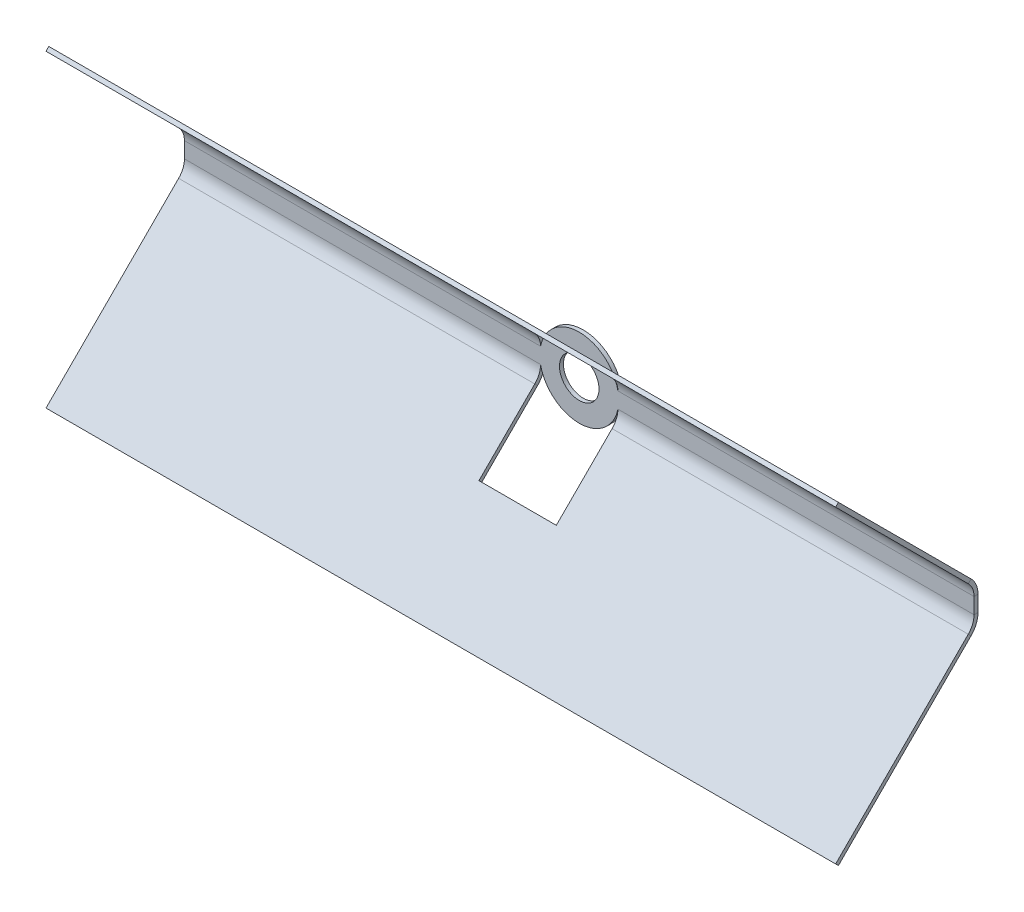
ISO-10303-21;
HEADER;
FILE_DESCRIPTION(('STEP AP214'),'2;1');
FILE_NAME('part.step','',(''),(''),'','','');
FILE_SCHEMA(('AUTOMOTIVE_DESIGN { 1 0 10303 214 1 1 1 1 }'));
ENDSEC;
DATA;
#1=APPLICATION_CONTEXT('core data for automotive mechanical design processes');
#2=APPLICATION_PROTOCOL_DEFINITION('international standard','automotive_design',2000,#1);
#3=PRODUCT_CONTEXT('',#1,'mechanical');
#4=PRODUCT('Part','Part','',(#3));
#5=PRODUCT_RELATED_PRODUCT_CATEGORY('part','',(#4));
#6=PRODUCT_DEFINITION_FORMATION('','',#4);
#7=PRODUCT_DEFINITION_CONTEXT('part definition',#1,'design');
#8=PRODUCT_DEFINITION('design','',#6,#7);
#9=PRODUCT_DEFINITION_SHAPE('','',#8);
#10=(LENGTH_UNIT() NAMED_UNIT(*) SI_UNIT(.MILLI.,.METRE.));
#11=(NAMED_UNIT(*) PLANE_ANGLE_UNIT() SI_UNIT($,.RADIAN.));
#12=(NAMED_UNIT(*) SI_UNIT($,.STERADIAN.) SOLID_ANGLE_UNIT());
#13=UNCERTAINTY_MEASURE_WITH_UNIT(LENGTH_MEASURE(1.E-05),#10,'distance_accuracy_value','');
#14=(GEOMETRIC_REPRESENTATION_CONTEXT(3) GLOBAL_UNCERTAINTY_ASSIGNED_CONTEXT((#13)) GLOBAL_UNIT_ASSIGNED_CONTEXT((#10,
#11,#12)) REPRESENTATION_CONTEXT('',''));
#15=CARTESIAN_POINT('',(0.,0.,0.));
#16=DIRECTION('',(0.,0.,1.));
#17=DIRECTION('',(1.,0.,0.));
#18=AXIS2_PLACEMENT_3D('',#15,#16,#17);
#19=CARTESIAN_POINT('',(-9.79795897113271,-39.8406204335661,34.3553390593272));
#20=DIRECTION('',(-1.,0.,0.));
#21=DIRECTION('',(0.,0.,1.));
#22=AXIS2_PLACEMENT_3D('',#19,#20,#21);
#23=PLANE('',#22);
#24=DIRECTION('',(0.,-0.707106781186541,-0.707106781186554));
#25=VECTOR('',#24,1.);
#26=CARTESIAN_POINT('',(-9.79795897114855,-20.3847763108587,14.8994949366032));
#27=LINE('',#26,#25);
#28=CARTESIAN_POINT('',(-9.79795897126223,-19.6776695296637,15.6066017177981));
#29=VERTEX_POINT('',#28);
#30=CARTESIAN_POINT('',(-9.79795897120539,-20.3847763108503,14.8994949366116));
#31=VERTEX_POINT('',#30);
#32=EDGE_CURVE('E277',#29,#31,#27,.T.);
#33=ORIENTED_EDGE('',*,*,#32,.T.);
#34=DIRECTION('',(0.,-0.707106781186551,0.707106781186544));
#35=VECTOR('',#34,1.);
#36=CARTESIAN_POINT('',(-9.79795897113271,-39.8406204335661,34.3553390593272));
#37=LINE('',#36,#35);
#38=CARTESIAN_POINT('',(-9.79795897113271,-6.24264068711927,0.75735931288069));
#39=VERTEX_POINT('',#38);
#40=EDGE_CURVE('E287',#39,#31,#37,.T.);
#41=ORIENTED_EDGE('',*,*,#40,.F.);
#42=DIRECTION('',(0.,0.707106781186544,0.707106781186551));
#43=VECTOR('',#42,1.);
#44=CARTESIAN_POINT('',(-9.79795897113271,-5.53553390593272,1.46446609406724));
#45=LINE('',#44,#43);
#46=CARTESIAN_POINT('',(-9.79795897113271,-5.53553390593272,1.46446609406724));
#47=VERTEX_POINT('',#46);
#48=EDGE_CURVE('E310',#47,#39,#45,.F.);
#49=ORIENTED_EDGE('',*,*,#48,.F.);
#50=DIRECTION('',(0.,0.707106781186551,-0.707106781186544));
#51=VECTOR('',#50,1.);
#52=CARTESIAN_POINT('',(-9.79795897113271,-39.1335136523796,35.0624458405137));
#53=LINE('',#52,#51);
#54=EDGE_CURVE('E289',#47,#29,#53,.F.);
#55=ORIENTED_EDGE('',*,*,#54,.T.);
#56=EDGE_LOOP('',(#33,#41,#49,#55));
#57=FACE_BOUND('',#56,.T.);
#58=ADVANCED_FACE('F113',(#57),#23,.F.);
#59=CARTESIAN_POINT('',(9.79795897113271,-4.77817459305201,-0.707106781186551));
#60=DIRECTION('',(1.,0.,0.));
#61=DIRECTION('',(0.,1.,0.));
#62=AXIS2_PLACEMENT_3D('',#59,#60,#61);
#63=PLANE('',#62);
#64=DIRECTION('',(0.,-0.70710678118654,-0.707106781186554));
#65=VECTOR('',#64,1.);
#66=CARTESIAN_POINT('',(9.79795897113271,-20.3847763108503,14.8994949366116));
#67=LINE('',#66,#65);
#68=CARTESIAN_POINT('',(9.79795897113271,-19.6776695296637,15.6066017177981));
#69=VERTEX_POINT('',#68);
#70=CARTESIAN_POINT('',(9.79795897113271,-20.3847763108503,14.8994949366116));
#71=VERTEX_POINT('',#70);
#72=EDGE_CURVE('E135',#69,#71,#67,.T.);
#73=ORIENTED_EDGE('',*,*,#72,.F.);
#74=DIRECTION('',(0.,-0.707106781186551,0.707106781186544));
#75=VECTOR('',#74,1.);
#76=CARTESIAN_POINT('',(9.79795897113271,-4.07106781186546,0.));
#77=LINE('',#76,#75);
#78=CARTESIAN_POINT('',(9.79795897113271,-5.53553390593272,1.46446609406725));
#79=VERTEX_POINT('',#78);
#80=EDGE_CURVE('E526',#69,#79,#77,.F.);
#81=ORIENTED_EDGE('',*,*,#80,.T.);
#82=DIRECTION('',(0.,0.707106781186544,0.707106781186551));
#83=VECTOR('',#82,1.);
#84=CARTESIAN_POINT('',(9.79795897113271,-6.24264068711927,0.757359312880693));
#85=LINE('',#84,#83);
#86=CARTESIAN_POINT('',(9.79795897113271,-6.24264068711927,0.757359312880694));
#87=VERTEX_POINT('',#86);
#88=EDGE_CURVE('E515',#79,#87,#85,.F.);
#89=ORIENTED_EDGE('',*,*,#88,.T.);
#90=DIRECTION('',(0.,0.707106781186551,-0.707106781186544));
#91=VECTOR('',#90,1.);
#92=CARTESIAN_POINT('',(9.79795897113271,-39.8406204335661,34.3553390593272));
#93=LINE('',#92,#91);
#94=EDGE_CURVE('E130',#71,#87,#93,.T.);
#95=ORIENTED_EDGE('',*,*,#94,.F.);
#96=EDGE_LOOP('',(#73,#81,#89,#95));
#97=FACE_BOUND('',#96,.T.);
#98=ADVANCED_FACE('F548',(#97),#63,.F.);
#99=CARTESIAN_POINT('',(-9.79795897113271,4.77817459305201,-0.707106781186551));
#100=DIRECTION('',(-1.,0.,0.));
#101=DIRECTION('',(0.,0.,1.));
#102=AXIS2_PLACEMENT_3D('',#99,#100,#101);
#103=PLANE('',#102);
#104=DIRECTION('',(0.,-0.70710678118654,0.707106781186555));
#105=VECTOR('',#104,1.);
#106=CARTESIAN_POINT('',(-9.79795897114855,17.8468127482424,12.3615313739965));
#107=LINE('',#106,#105);
#108=CARTESIAN_POINT('',(-9.79795897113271,17.8468127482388,12.3615313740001));
#109=VERTEX_POINT('',#108);
#110=CARTESIAN_POINT('',(-9.79795897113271,17.1397059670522,13.0686381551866));
#111=VERTEX_POINT('',#110);
#112=EDGE_CURVE('E518',#109,#111,#107,.T.);
#113=ORIENTED_EDGE('',*,*,#112,.T.);
#114=DIRECTION('',(0.,0.707106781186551,0.707106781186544));
#115=VECTOR('',#114,1.);
#116=CARTESIAN_POINT('',(-9.79795897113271,4.07106781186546,0.));
#117=LINE('',#116,#115);
#118=CARTESIAN_POINT('',(-9.79795897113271,5.53553390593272,1.46446609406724));
#119=VERTEX_POINT('',#118);
#120=EDGE_CURVE('E383',#111,#119,#117,.F.);
#121=ORIENTED_EDGE('',*,*,#120,.T.);
#122=DIRECTION('',(0.,-0.707106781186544,0.707106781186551));
#123=VECTOR('',#122,1.);
#124=CARTESIAN_POINT('',(-9.79795897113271,6.24264068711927,0.757359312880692));
#125=LINE('',#124,#123);
#126=CARTESIAN_POINT('',(-9.79795897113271,6.24264068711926,0.757359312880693));
#127=VERTEX_POINT('',#126);
#128=EDGE_CURVE('E360',#119,#127,#125,.F.);
#129=ORIENTED_EDGE('',*,*,#128,.T.);
#130=DIRECTION('',(0.,-0.707106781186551,-0.707106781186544));
#131=VECTOR('',#130,1.);
#132=CARTESIAN_POINT('',(-9.79795897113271,39.8406204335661,34.3553390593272));
#133=LINE('',#132,#131);
#134=EDGE_CURVE('E377',#109,#127,#133,.T.);
#135=ORIENTED_EDGE('',*,*,#134,.F.);
#136=EDGE_LOOP('',(#113,#121,#129,#135));
#137=FACE_BOUND('',#136,.T.);
#138=ADVANCED_FACE('F592',(#137),#103,.F.);
#139=CARTESIAN_POINT('',(9.79795897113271,39.8406204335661,34.3553390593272));
#140=DIRECTION('',(1.,0.,0.));
#141=DIRECTION('',(0.,0.,-1.));
#142=AXIS2_PLACEMENT_3D('',#139,#140,#141);
#143=PLANE('',#142);
#144=DIRECTION('',(0.,-0.70710678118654,0.707106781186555));
#145=VECTOR('',#144,1.);
#146=CARTESIAN_POINT('',(9.79795897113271,17.8468127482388,12.3615313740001));
#147=LINE('',#146,#145);
#148=CARTESIAN_POINT('',(9.79795897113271,17.8468127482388,12.3615313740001));
#149=VERTEX_POINT('',#148);
#150=CARTESIAN_POINT('',(9.79795897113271,17.1397059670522,13.0686381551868));
#151=VERTEX_POINT('',#150);
#152=EDGE_CURVE('E539',#149,#151,#147,.T.);
#153=ORIENTED_EDGE('',*,*,#152,.F.);
#154=DIRECTION('',(0.,0.707106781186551,0.707106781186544));
#155=VECTOR('',#154,1.);
#156=CARTESIAN_POINT('',(9.79795897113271,39.8406204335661,34.3553390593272));
#157=LINE('',#156,#155);
#158=CARTESIAN_POINT('',(9.79795897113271,6.24264068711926,0.757359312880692));
#159=VERTEX_POINT('',#158);
#160=EDGE_CURVE('E336',#159,#149,#157,.T.);
#161=ORIENTED_EDGE('',*,*,#160,.F.);
#162=DIRECTION('',(0.,-0.707106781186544,0.707106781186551));
#163=VECTOR('',#162,1.);
#164=CARTESIAN_POINT('',(9.79795897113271,5.53553390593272,1.46446609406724));
#165=LINE('',#164,#163);
#166=CARTESIAN_POINT('',(9.79795897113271,5.53553390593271,1.46446609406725));
#167=VERTEX_POINT('',#166);
#168=EDGE_CURVE('E350',#167,#159,#165,.F.);
#169=ORIENTED_EDGE('',*,*,#168,.F.);
#170=DIRECTION('',(0.,-0.707106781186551,-0.707106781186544));
#171=VECTOR('',#170,1.);
#172=CARTESIAN_POINT('',(9.79795897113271,39.1335136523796,35.0624458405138));
#173=LINE('',#172,#171);
#174=EDGE_CURVE('E342',#167,#151,#173,.F.);
#175=ORIENTED_EDGE('',*,*,#174,.T.);
#176=EDGE_LOOP('',(#153,#161,#169,#175));
#177=FACE_BOUND('',#176,.T.);
#178=ADVANCED_FACE('F955',(#177),#143,.F.);
#179=CARTESIAN_POINT('',(-100.,2.,-1.));
#180=DIRECTION('',(-1.,0.,0.));
#181=DIRECTION('',(0.,0.,1.));
#182=AXIS2_PLACEMENT_3D('',#179,#180,#181);
#183=PLANE('',#182);
#184=DIRECTION('',(0.,-1.,0.));
#185=VECTOR('',#184,1.);
#186=CARTESIAN_POINT('',(-100.,2.,0.));
#187=LINE('',#186,#185);
#188=CARTESIAN_POINT('',(-100.,2.,0.));
#189=VERTEX_POINT('',#188);
#190=CARTESIAN_POINT('',(-100.,-2.,0.));
#191=VERTEX_POINT('',#190);
#192=EDGE_CURVE('E410',#189,#191,#187,.T.);
#193=ORIENTED_EDGE('',*,*,#192,.F.);
#194=DIRECTION('',(0.,0.,1.));
#195=VECTOR('',#194,1.);
#196=CARTESIAN_POINT('',(-100.,2.,-1.));
#197=LINE('',#196,#195);
#198=CARTESIAN_POINT('',(-100.,2.,-0.999999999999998));
#199=VERTEX_POINT('',#198);
#200=EDGE_CURVE('E13',#199,#189,#197,.T.);
#201=ORIENTED_EDGE('',*,*,#200,.F.);
#202=DIRECTION('',(0.,-1.,0.));
#203=VECTOR('',#202,1.);
#204=CARTESIAN_POINT('',(-100.,2.,-1.));
#205=LINE('',#204,#203);
#206=CARTESIAN_POINT('',(-100.,-2.,-1.));
#207=VERTEX_POINT('',#206);
#208=EDGE_CURVE('E413',#199,#207,#205,.T.);
#209=ORIENTED_EDGE('',*,*,#208,.T.);
#210=DIRECTION('',(0.,0.,1.));
#211=VECTOR('',#210,1.);
#212=CARTESIAN_POINT('',(-100.,-2.,-1.));
#213=LINE('',#212,#211);
#214=EDGE_CURVE('E117',#207,#191,#213,.T.);
#215=ORIENTED_EDGE('',*,*,#214,.T.);
#216=EDGE_LOOP('',(#193,#201,#209,#215));
#217=FACE_BOUND('',#216,.T.);
#218=ADVANCED_FACE('F115',(#217),#183,.T.);
#219=CARTESIAN_POINT('',(0.,0.,-1.));
#220=DIRECTION('',(0.,0.,1.));
#221=DIRECTION('',(1.,0.,0.));
#222=AXIS2_PLACEMENT_3D('',#219,#220,#221);
#223=CYLINDRICAL_SURFACE('',#222,10.);
#224=CARTESIAN_POINT('',(0.,0.,0.));
#225=DIRECTION('',(0.,0.,1.));
#226=DIRECTION('',(1.,0.,0.));
#227=AXIS2_PLACEMENT_3D('',#224,#225,#226);
#228=CIRCLE('',#227,10.);
#229=CARTESIAN_POINT('',(9.79795897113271,2.,0.));
#230=VERTEX_POINT('',#229);
#231=CARTESIAN_POINT('',(-9.79795897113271,2.,0.));
#232=VERTEX_POINT('',#231);
#233=EDGE_CURVE('E454',#230,#232,#228,.T.);
#234=ORIENTED_EDGE('',*,*,#233,.F.);
#235=DIRECTION('',(0.,0.,1.));
#236=VECTOR('',#235,1.);
#237=CARTESIAN_POINT('',(9.79795897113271,2.,-1.));
#238=LINE('',#237,#236);
#239=CARTESIAN_POINT('',(9.79795897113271,2.,-0.999999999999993));
#240=VERTEX_POINT('',#239);
#241=EDGE_CURVE('E460',#240,#230,#238,.T.);
#242=ORIENTED_EDGE('',*,*,#241,.F.);
#243=CARTESIAN_POINT('',(0.,0.,-1.));
#244=DIRECTION('',(0.,0.,1.));
#245=DIRECTION('',(1.,0.,0.));
#246=AXIS2_PLACEMENT_3D('',#243,#244,#245);
#247=CIRCLE('',#246,10.);
#248=CARTESIAN_POINT('',(-9.79795897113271,2.,-1.));
#249=VERTEX_POINT('',#248);
#250=EDGE_CURVE('E432',#240,#249,#247,.T.);
#251=ORIENTED_EDGE('',*,*,#250,.T.);
#252=DIRECTION('',(0.,0.,1.));
#253=VECTOR('',#252,1.);
#254=CARTESIAN_POINT('',(-9.79795897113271,2.,-1.));
#255=LINE('',#254,#253);
#256=EDGE_CURVE('E122',#249,#232,#255,.T.);
#257=ORIENTED_EDGE('',*,*,#256,.T.);
#258=EDGE_LOOP('',(#234,#242,#251,#257));
#259=FACE_BOUND('',#258,.T.);
#260=ADVANCED_FACE('F937',(#259),#223,.T.);
#261=CARTESIAN_POINT('',(100.,2.,-1.));
#262=DIRECTION('',(1.,0.,0.));
#263=DIRECTION('',(0.,0.,-1.));
#264=AXIS2_PLACEMENT_3D('',#261,#262,#263);
#265=PLANE('',#264);
#266=DIRECTION('',(0.,1.,0.));
#267=VECTOR('',#266,1.);
#268=CARTESIAN_POINT('',(100.,2.,0.));
#269=LINE('',#268,#267);
#270=CARTESIAN_POINT('',(100.,-2.,0.));
#271=VERTEX_POINT('',#270);
#272=CARTESIAN_POINT('',(100.,2.,0.));
#273=VERTEX_POINT('',#272);
#274=EDGE_CURVE('E448',#271,#273,#269,.T.);
#275=ORIENTED_EDGE('',*,*,#274,.F.);
#276=DIRECTION('',(0.,0.,1.));
#277=VECTOR('',#276,1.);
#278=CARTESIAN_POINT('',(100.,-2.,-1.));
#279=LINE('',#278,#277);
#280=CARTESIAN_POINT('',(100.,-2.,-1.00000000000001));
#281=VERTEX_POINT('',#280);
#282=EDGE_CURVE('E465',#281,#271,#279,.T.);
#283=ORIENTED_EDGE('',*,*,#282,.F.);
#284=DIRECTION('',(0.,1.,0.));
#285=VECTOR('',#284,1.);
#286=CARTESIAN_POINT('',(100.,2.,-1.));
#287=LINE('',#286,#285);
#288=CARTESIAN_POINT('',(100.,2.,-1.));
#289=VERTEX_POINT('',#288);
#290=EDGE_CURVE('E426',#281,#289,#287,.T.);
#291=ORIENTED_EDGE('',*,*,#290,.T.);
#292=DIRECTION('',(0.,0.,1.));
#293=VECTOR('',#292,1.);
#294=CARTESIAN_POINT('',(100.,2.,-1.));
#295=LINE('',#294,#293);
#296=EDGE_CURVE('E463',#289,#273,#295,.T.);
#297=ORIENTED_EDGE('',*,*,#296,.T.);
#298=EDGE_LOOP('',(#275,#283,#291,#297));
#299=FACE_BOUND('',#298,.T.);
#300=ADVANCED_FACE('F564',(#299),#265,.T.);
#301=CARTESIAN_POINT('',(0.,0.,-1.));
#302=DIRECTION('',(0.,0.,1.));
#303=DIRECTION('',(1.,0.,0.));
#304=AXIS2_PLACEMENT_3D('',#301,#302,#303);
#305=CYLINDRICAL_SURFACE('',#304,10.);
#306=CARTESIAN_POINT('',(0.,0.,0.));
#307=DIRECTION('',(0.,0.,1.));
#308=DIRECTION('',(1.,0.,0.));
#309=AXIS2_PLACEMENT_3D('',#306,#307,#308);
#310=CIRCLE('',#309,10.);
#311=CARTESIAN_POINT('',(-9.79795897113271,-2.,0.));
#312=VERTEX_POINT('',#311);
#313=CARTESIAN_POINT('',(9.79795897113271,-2.,0.));
#314=VERTEX_POINT('',#313);
#315=EDGE_CURVE('E442',#312,#314,#310,.T.);
#316=ORIENTED_EDGE('',*,*,#315,.F.);
#317=DIRECTION('',(0.,0.,1.));
#318=VECTOR('',#317,1.);
#319=CARTESIAN_POINT('',(-9.79795897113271,-2.,-1.));
#320=LINE('',#319,#318);
#321=CARTESIAN_POINT('',(-9.79795897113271,-2.,-0.999999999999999));
#322=VERTEX_POINT('',#321);
#323=EDGE_CURVE('E469',#322,#312,#320,.T.);
#324=ORIENTED_EDGE('',*,*,#323,.F.);
#325=CARTESIAN_POINT('',(0.,0.,-1.));
#326=DIRECTION('',(0.,0.,1.));
#327=DIRECTION('',(1.,0.,0.));
#328=AXIS2_PLACEMENT_3D('',#325,#326,#327);
#329=CIRCLE('',#328,10.);
#330=CARTESIAN_POINT('',(9.79795897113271,-2.,-1.));
#331=VERTEX_POINT('',#330);
#332=EDGE_CURVE('E420',#322,#331,#329,.T.);
#333=ORIENTED_EDGE('',*,*,#332,.T.);
#334=DIRECTION('',(0.,0.,1.));
#335=VECTOR('',#334,1.);
#336=CARTESIAN_POINT('',(9.79795897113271,-2.,-1.));
#337=LINE('',#336,#335);
#338=EDGE_CURVE('E468',#331,#314,#337,.T.);
#339=ORIENTED_EDGE('',*,*,#338,.T.);
#340=EDGE_LOOP('',(#316,#324,#333,#339));
#341=FACE_BOUND('',#340,.T.);
#342=ADVANCED_FACE('F571',(#341),#305,.T.);
#343=CARTESIAN_POINT('',(0.,0.,-1.));
#344=DIRECTION('',(0.,0.,1.));
#345=DIRECTION('',(1.,0.,0.));
#346=AXIS2_PLACEMENT_3D('',#343,#344,#345);
#347=PLANE('',#346);
#348=CARTESIAN_POINT('',(0.,0.,-1.));
#349=DIRECTION('',(0.,0.,1.));
#350=DIRECTION('',(1.,0.,0.));
#351=AXIS2_PLACEMENT_3D('',#348,#349,#350);
#352=CIRCLE('',#351,5.);
#353=CARTESIAN_POINT('',(5.,0.,-1.));
#354=VERTEX_POINT('',#353);
#355=EDGE_CURVE('E407',#354,#354,#352,.T.);
#356=ORIENTED_EDGE('',*,*,#355,.T.);
#357=EDGE_LOOP('',(#356));
#358=FACE_BOUND('',#357,.T.);
#359=ORIENTED_EDGE('',*,*,#208,.F.);
#360=DIRECTION('',(-1.,0.,0.));
#361=VECTOR('',#360,1.);
#362=CARTESIAN_POINT('',(-100.,2.,-1.));
#363=LINE('',#362,#361);
#364=EDGE_CURVE('E434',#249,#199,#363,.T.);
#365=ORIENTED_EDGE('',*,*,#364,.F.);
#366=ORIENTED_EDGE('',*,*,#250,.F.);
#367=DIRECTION('',(-1.,0.,0.));
#368=VECTOR('',#367,1.);
#369=CARTESIAN_POINT('',(9.79795897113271,2.,-1.));
#370=LINE('',#369,#368);
#371=EDGE_CURVE('E429',#289,#240,#370,.T.);
#372=ORIENTED_EDGE('',*,*,#371,.F.);
#373=ORIENTED_EDGE('',*,*,#290,.F.);
#374=DIRECTION('',(1.,0.,0.));
#375=VECTOR('',#374,1.);
#376=CARTESIAN_POINT('',(9.79795897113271,-2.,-1.));
#377=LINE('',#376,#375);
#378=EDGE_CURVE('E423',#331,#281,#377,.T.);
#379=ORIENTED_EDGE('',*,*,#378,.F.);
#380=ORIENTED_EDGE('',*,*,#332,.F.);
#381=DIRECTION('',(1.,0.,0.));
#382=VECTOR('',#381,1.);
#383=CARTESIAN_POINT('',(-100.,-2.,-1.));
#384=LINE('',#383,#382);
#385=EDGE_CURVE('E416',#207,#322,#384,.T.);
#386=ORIENTED_EDGE('',*,*,#385,.F.);
#387=EDGE_LOOP('',(#359,#365,#366,#372,#373,#379,#380,#386));
#388=FACE_BOUND('',#387,.T.);
#389=ADVANCED_FACE('F569',(#358,#388),#347,.F.);
#390=CARTESIAN_POINT('',(0.,0.,0.));
#391=DIRECTION('',(0.,0.,1.));
#392=DIRECTION('',(1.,0.,0.));
#393=AXIS2_PLACEMENT_3D('',#390,#391,#392);
#394=PLANE('',#393);
#395=CARTESIAN_POINT('',(0.,0.,0.));
#396=DIRECTION('',(0.,0.,1.));
#397=DIRECTION('',(1.,0.,0.));
#398=AXIS2_PLACEMENT_3D('',#395,#396,#397);
#399=CIRCLE('',#398,5.);
#400=CARTESIAN_POINT('',(5.,0.,0.));
#401=VERTEX_POINT('',#400);
#402=EDGE_CURVE('E398',#401,#401,#399,.T.);
#403=ORIENTED_EDGE('',*,*,#402,.F.);
#404=EDGE_LOOP('',(#403));
#405=FACE_BOUND('',#404,.T.);
#406=ORIENTED_EDGE('',*,*,#192,.T.);
#407=DIRECTION('',(1.,0.,0.));
#408=VECTOR('',#407,1.);
#409=CARTESIAN_POINT('',(-100.,-2.,0.));
#410=LINE('',#409,#408);
#411=EDGE_CURVE('E439',#191,#312,#410,.T.);
#412=ORIENTED_EDGE('',*,*,#411,.T.);
#413=ORIENTED_EDGE('',*,*,#315,.T.);
#414=DIRECTION('',(1.,0.,0.));
#415=VECTOR('',#414,1.);
#416=CARTESIAN_POINT('',(9.79795897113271,-2.,0.));
#417=LINE('',#416,#415);
#418=EDGE_CURVE('E445',#314,#271,#417,.T.);
#419=ORIENTED_EDGE('',*,*,#418,.T.);
#420=ORIENTED_EDGE('',*,*,#274,.T.);
#421=DIRECTION('',(-1.,0.,0.));
#422=VECTOR('',#421,1.);
#423=CARTESIAN_POINT('',(9.79795897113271,2.,0.));
#424=LINE('',#423,#422);
#425=EDGE_CURVE('E451',#273,#230,#424,.T.);
#426=ORIENTED_EDGE('',*,*,#425,.T.);
#427=ORIENTED_EDGE('',*,*,#233,.T.);
#428=DIRECTION('',(-1.,0.,0.));
#429=VECTOR('',#428,1.);
#430=CARTESIAN_POINT('',(-100.,2.,0.));
#431=LINE('',#430,#429);
#432=EDGE_CURVE('E417',#232,#189,#431,.T.);
#433=ORIENTED_EDGE('',*,*,#432,.T.);
#434=EDGE_LOOP('',(#406,#412,#413,#419,#420,#426,#427,#433));
#435=FACE_BOUND('',#434,.T.);
#436=ADVANCED_FACE('F482',(#405,#435),#394,.T.);
#437=CARTESIAN_POINT('',(0.,0.,-1.));
#438=DIRECTION('',(0.,0.,1.));
#439=DIRECTION('',(1.,0.,0.));
#440=AXIS2_PLACEMENT_3D('',#437,#438,#439);
#441=CYLINDRICAL_SURFACE('',#440,5.);
#442=ORIENTED_EDGE('',*,*,#355,.F.);
#443=EDGE_LOOP('',(#442));
#444=FACE_BOUND('',#443,.T.);
#445=ORIENTED_EDGE('',*,*,#402,.T.);
#446=EDGE_LOOP('',(#445));
#447=FACE_BOUND('',#446,.T.);
#448=ADVANCED_FACE('F887',(#444,#447),#441,.F.);
#449=CARTESIAN_POINT('',(-9.79795897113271,2.,5.));
#450=DIRECTION('',(1.,0.,0.));
#451=DIRECTION('',(0.,1.,0.));
#452=AXIS2_PLACEMENT_3D('',#449,#450,#451);
#453=PLANE('',#452);
#454=ORIENTED_EDGE('',*,*,#128,.F.);
#455=CARTESIAN_POINT('',(-9.79795897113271,2.,5.));
#456=DIRECTION('',(-1.,0.,0.));
#457=DIRECTION('',(0.,-1.,0.));
#458=AXIS2_PLACEMENT_3D('',#455,#456,#457);
#459=CIRCLE('',#458,5.);
#460=EDGE_CURVE('E402',#232,#119,#459,.F.);
#461=ORIENTED_EDGE('',*,*,#460,.F.);
#462=ORIENTED_EDGE('',*,*,#256,.F.);
#463=CARTESIAN_POINT('',(-9.79795897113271,2.,5.));
#464=DIRECTION('',(-1.,0.,0.));
#465=DIRECTION('',(0.,-1.,0.));
#466=AXIS2_PLACEMENT_3D('',#463,#464,#465);
#467=CIRCLE('',#466,6.);
#468=EDGE_CURVE('E395',#249,#127,#467,.F.);
#469=ORIENTED_EDGE('',*,*,#468,.T.);
#470=EDGE_LOOP('',(#454,#461,#462,#469));
#471=FACE_BOUND('',#470,.T.);
#472=ADVANCED_FACE('F868',(#471),#453,.T.);
#473=CARTESIAN_POINT('',(-100.,2.,5.));
#474=DIRECTION('',(1.,0.,0.));
#475=DIRECTION('',(0.,1.,0.));
#476=AXIS2_PLACEMENT_3D('',#473,#474,#475);
#477=PLANE('',#476);
#478=CARTESIAN_POINT('',(-100.,2.,5.));
#479=DIRECTION('',(-1.,0.,0.));
#480=DIRECTION('',(0.,-1.,0.));
#481=AXIS2_PLACEMENT_3D('',#478,#479,#480);
#482=CIRCLE('',#481,5.);
#483=CARTESIAN_POINT('',(-100.,5.53553390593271,1.46446609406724));
#484=VERTEX_POINT('',#483);
#485=EDGE_CURVE('E372',#484,#189,#482,.T.);
#486=ORIENTED_EDGE('',*,*,#485,.F.);
#487=DIRECTION('',(0.,-0.707106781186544,0.707106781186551));
#488=VECTOR('',#487,1.);
#489=CARTESIAN_POINT('',(-100.,5.53553390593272,1.46446609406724));
#490=LINE('',#489,#488);
#491=CARTESIAN_POINT('',(-100.,6.24264068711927,0.757359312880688));
#492=VERTEX_POINT('',#491);
#493=EDGE_CURVE('E388',#484,#492,#490,.F.);
#494=ORIENTED_EDGE('',*,*,#493,.T.);
#495=CARTESIAN_POINT('',(-100.,2.,5.));
#496=DIRECTION('',(-1.,0.,0.));
#497=DIRECTION('',(0.,-1.,0.));
#498=AXIS2_PLACEMENT_3D('',#495,#496,#497);
#499=CIRCLE('',#498,6.);
#500=EDGE_CURVE('E399',#492,#199,#499,.T.);
#501=ORIENTED_EDGE('',*,*,#500,.T.);
#502=ORIENTED_EDGE('',*,*,#200,.T.);
#503=EDGE_LOOP('',(#486,#494,#501,#502));
#504=FACE_BOUND('',#503,.T.);
#505=ADVANCED_FACE('F857',(#504),#477,.F.);
#506=CARTESIAN_POINT('',(-100.,2.,5.));
#507=DIRECTION('',(-1.,0.,0.));
#508=DIRECTION('',(0.,0.707106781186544,-0.707106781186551));
#509=AXIS2_PLACEMENT_3D('',#506,#507,#508);
#510=CYLINDRICAL_SURFACE('',#509,6.);
#511=ORIENTED_EDGE('',*,*,#364,.T.);
#512=ORIENTED_EDGE('',*,*,#500,.F.);
#513=DIRECTION('',(-1.,0.,0.));
#514=VECTOR('',#513,1.);
#515=CARTESIAN_POINT('',(-9.79795897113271,6.24264068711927,0.757359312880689));
#516=LINE('',#515,#514);
#517=EDGE_CURVE('E385',#492,#127,#516,.F.);
#518=ORIENTED_EDGE('',*,*,#517,.T.);
#519=ORIENTED_EDGE('',*,*,#468,.F.);
#520=EDGE_LOOP('',(#511,#512,#518,#519));
#521=FACE_BOUND('',#520,.T.);
#522=ADVANCED_FACE('F854',(#521),#510,.T.);
#523=CARTESIAN_POINT('',(-100.,2.,5.));
#524=DIRECTION('',(-1.,0.,0.));
#525=DIRECTION('',(0.,0.707106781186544,-0.707106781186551));
#526=AXIS2_PLACEMENT_3D('',#523,#524,#525);
#527=CYLINDRICAL_SURFACE('',#526,5.);
#528=ORIENTED_EDGE('',*,*,#432,.F.);
#529=ORIENTED_EDGE('',*,*,#460,.T.);
#530=DIRECTION('',(-1.,0.,0.));
#531=VECTOR('',#530,1.);
#532=CARTESIAN_POINT('',(-9.79795897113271,5.53553390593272,1.46446609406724));
#533=LINE('',#532,#531);
#534=EDGE_CURVE('E391',#119,#484,#533,.T.);
#535=ORIENTED_EDGE('',*,*,#534,.T.);
#536=ORIENTED_EDGE('',*,*,#485,.T.);
#537=EDGE_LOOP('',(#528,#529,#535,#536));
#538=FACE_BOUND('',#537,.T.);
#539=ADVANCED_FACE('F843',(#538),#527,.F.);
#540=CARTESIAN_POINT('',(-100.,39.8406204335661,34.3553390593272));
#541=DIRECTION('',(1.,0.,0.));
#542=DIRECTION('',(0.,0.,-1.));
#543=AXIS2_PLACEMENT_3D('',#540,#541,#542);
#544=PLANE('',#543);
#545=ORIENTED_EDGE('',*,*,#493,.F.);
#546=DIRECTION('',(0.,-0.707106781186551,-0.707106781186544));
#547=VECTOR('',#546,1.);
#548=CARTESIAN_POINT('',(-100.,39.1335136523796,35.0624458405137));
#549=LINE('',#548,#547);
#550=CARTESIAN_POINT('',(-100.,39.1335136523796,35.0624458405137));
#551=VERTEX_POINT('',#550);
#552=EDGE_CURVE('E381',#484,#551,#549,.F.);
#553=ORIENTED_EDGE('',*,*,#552,.T.);
#554=DIRECTION('',(0.,-0.707106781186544,0.707106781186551));
#555=VECTOR('',#554,1.);
#556=CARTESIAN_POINT('',(-100.,39.8406204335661,34.3553390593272));
#557=LINE('',#556,#555);
#558=CARTESIAN_POINT('',(-100.,39.8406204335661,34.3553390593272));
#559=VERTEX_POINT('',#558);
#560=EDGE_CURVE('E369',#559,#551,#557,.T.);
#561=ORIENTED_EDGE('',*,*,#560,.F.);
#562=DIRECTION('',(0.,0.707106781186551,0.707106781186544));
#563=VECTOR('',#562,1.);
#564=CARTESIAN_POINT('',(-100.,39.8406204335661,34.3553390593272));
#565=LINE('',#564,#563);
#566=EDGE_CURVE('E375',#492,#559,#565,.T.);
#567=ORIENTED_EDGE('',*,*,#566,.F.);
#568=EDGE_LOOP('',(#545,#553,#561,#567));
#569=FACE_BOUND('',#568,.T.);
#570=ADVANCED_FACE('F831',(#569),#544,.F.);
#571=CARTESIAN_POINT('',(-9.79795897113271,39.8406204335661,34.3553390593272));
#572=DIRECTION('',(0.,-0.707106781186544,0.707106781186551));
#573=DIRECTION('',(0.,-0.707106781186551,-0.707106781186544));
#574=AXIS2_PLACEMENT_3D('',#571,#572,#573);
#575=PLANE('',#574);
#576=ORIENTED_EDGE('',*,*,#517,.F.);
#577=ORIENTED_EDGE('',*,*,#566,.T.);
#578=DIRECTION('',(1.,0.,0.));
#579=VECTOR('',#578,1.);
#580=CARTESIAN_POINT('',(-9.79795897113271,39.8406204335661,34.3553390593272));
#581=LINE('',#580,#579);
#582=CARTESIAN_POINT('',(100.,39.8406204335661,34.3553390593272));
#583=VERTEX_POINT('',#582);
#584=EDGE_CURVE('E373',#559,#583,#581,.T.);
#585=ORIENTED_EDGE('',*,*,#584,.T.);
#586=DIRECTION('',(0.,-0.707106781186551,-0.707106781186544));
#587=VECTOR('',#586,1.);
#588=CARTESIAN_POINT('',(100.,39.8406204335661,34.3553390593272));
#589=LINE('',#588,#587);
#590=CARTESIAN_POINT('',(100.,6.24264068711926,0.75735931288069));
#591=VERTEX_POINT('',#590);
#592=EDGE_CURVE('E339',#583,#591,#589,.T.);
#593=ORIENTED_EDGE('',*,*,#592,.T.);
#594=DIRECTION('',(-1.,0.,0.));
#595=VECTOR('',#594,1.);
#596=CARTESIAN_POINT('',(100.,6.24264068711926,0.757359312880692));
#597=LINE('',#596,#595);
#598=EDGE_CURVE('E348',#159,#591,#597,.F.);
#599=ORIENTED_EDGE('',*,*,#598,.F.);
#600=ORIENTED_EDGE('',*,*,#160,.T.);
#601=DIRECTION('',(1.,0.,0.));
#602=VECTOR('',#601,1.);
#603=CARTESIAN_POINT('',(-500000.,17.8468127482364,12.3615313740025));
#604=LINE('',#603,#602);
#605=EDGE_CURVE('E535',#109,#149,#604,.T.);
#606=ORIENTED_EDGE('',*,*,#605,.F.);
#607=ORIENTED_EDGE('',*,*,#134,.T.);
#608=EDGE_LOOP('',(#576,#577,#585,#593,#599,#600,#606,#607));
#609=FACE_BOUND('',#608,.T.);
#610=ADVANCED_FACE('F818',(#609),#575,.F.);
#611=CARTESIAN_POINT('',(-9.79795897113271,39.1335136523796,35.0624458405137));
#612=DIRECTION('',(0.,-0.707106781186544,0.707106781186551));
#613=DIRECTION('',(0.,-0.707106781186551,-0.707106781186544));
#614=AXIS2_PLACEMENT_3D('',#611,#612,#613);
#615=PLANE('',#614);
#616=ORIENTED_EDGE('',*,*,#552,.F.);
#617=ORIENTED_EDGE('',*,*,#534,.F.);
#618=ORIENTED_EDGE('',*,*,#120,.F.);
#619=DIRECTION('',(1.,0.,0.));
#620=VECTOR('',#619,1.);
#621=CARTESIAN_POINT('',(-500000.,17.1397059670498,13.0686381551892));
#622=LINE('',#621,#620);
#623=EDGE_CURVE('E537',#111,#151,#622,.T.);
#624=ORIENTED_EDGE('',*,*,#623,.T.);
#625=ORIENTED_EDGE('',*,*,#174,.F.);
#626=DIRECTION('',(-1.,0.,0.));
#627=VECTOR('',#626,1.);
#628=CARTESIAN_POINT('',(100.,5.53553390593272,1.46446609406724));
#629=LINE('',#628,#627);
#630=CARTESIAN_POINT('',(100.,5.53553390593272,1.46446609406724));
#631=VERTEX_POINT('',#630);
#632=EDGE_CURVE('E353',#631,#167,#629,.T.);
#633=ORIENTED_EDGE('',*,*,#632,.F.);
#634=DIRECTION('',(0.,0.707106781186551,0.707106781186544));
#635=VECTOR('',#634,1.);
#636=CARTESIAN_POINT('',(100.,4.07106781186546,0.));
#637=LINE('',#636,#635);
#638=CARTESIAN_POINT('',(100.,39.1335136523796,35.0624458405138));
#639=VERTEX_POINT('',#638);
#640=EDGE_CURVE('E345',#639,#631,#637,.F.);
#641=ORIENTED_EDGE('',*,*,#640,.F.);
#642=DIRECTION('',(-1.,0.,0.));
#643=VECTOR('',#642,1.);
#644=CARTESIAN_POINT('',(-9.79795897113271,39.1335136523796,35.0624458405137));
#645=LINE('',#644,#643);
#646=EDGE_CURVE('E379',#551,#639,#645,.F.);
#647=ORIENTED_EDGE('',*,*,#646,.F.);
#648=EDGE_LOOP('',(#616,#617,#618,#624,#625,#633,#641,#647));
#649=FACE_BOUND('',#648,.T.);
#650=ADVANCED_FACE('F804',(#649),#615,.T.);
#651=CARTESIAN_POINT('',(-9.79795897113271,39.8406204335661,34.3553390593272));
#652=DIRECTION('',(0.,-0.707106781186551,-0.707106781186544));
#653=DIRECTION('',(0.,0.707106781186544,-0.707106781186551));
#654=AXIS2_PLACEMENT_3D('',#651,#652,#653);
#655=PLANE('',#654);
#656=ORIENTED_EDGE('',*,*,#646,.T.);
#657=DIRECTION('',(0.,-0.707106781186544,0.707106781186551));
#658=VECTOR('',#657,1.);
#659=CARTESIAN_POINT('',(100.,39.8406204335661,34.3553390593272));
#660=LINE('',#659,#658);
#661=EDGE_CURVE('E332',#583,#639,#660,.T.);
#662=ORIENTED_EDGE('',*,*,#661,.F.);
#663=ORIENTED_EDGE('',*,*,#584,.F.);
#664=ORIENTED_EDGE('',*,*,#560,.T.);
#665=EDGE_LOOP('',(#656,#662,#663,#664));
#666=FACE_BOUND('',#665,.T.);
#667=ADVANCED_FACE('F792',(#666),#655,.F.);
#668=CARTESIAN_POINT('',(100.,2.,4.99999999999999));
#669=DIRECTION('',(1.,0.,0.));
#670=DIRECTION('',(0.,0.,-1.));
#671=AXIS2_PLACEMENT_3D('',#668,#669,#670);
#672=PLANE('',#671);
#673=DIRECTION('',(0.,-0.707106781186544,0.707106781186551));
#674=VECTOR('',#673,1.);
#675=CARTESIAN_POINT('',(100.,6.24264068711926,0.757359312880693));
#676=LINE('',#675,#674);
#677=EDGE_CURVE('E322',#631,#591,#676,.F.);
#678=ORIENTED_EDGE('',*,*,#677,.F.);
#679=CARTESIAN_POINT('',(100.,2.,4.99999999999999));
#680=DIRECTION('',(-1.,0.,0.));
#681=DIRECTION('',(0.,0.,1.));
#682=AXIS2_PLACEMENT_3D('',#679,#680,#681);
#683=CIRCLE('',#682,4.99999999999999);
#684=EDGE_CURVE('E364',#273,#631,#683,.F.);
#685=ORIENTED_EDGE('',*,*,#684,.F.);
#686=ORIENTED_EDGE('',*,*,#296,.F.);
#687=CARTESIAN_POINT('',(100.,2.,4.99999999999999));
#688=DIRECTION('',(-1.,0.,0.));
#689=DIRECTION('',(0.,0.,1.));
#690=AXIS2_PLACEMENT_3D('',#687,#688,#689);
#691=CIRCLE('',#690,5.99999999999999);
#692=EDGE_CURVE('E357',#289,#591,#691,.F.);
#693=ORIENTED_EDGE('',*,*,#692,.T.);
#694=EDGE_LOOP('',(#678,#685,#686,#693));
#695=FACE_BOUND('',#694,.T.);
#696=ADVANCED_FACE('F773',(#695),#672,.T.);
#697=CARTESIAN_POINT('',(9.79795897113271,2.,5.));
#698=DIRECTION('',(1.,0.,0.));
#699=DIRECTION('',(0.,0.,-1.));
#700=AXIS2_PLACEMENT_3D('',#697,#698,#699);
#701=PLANE('',#700);
#702=CARTESIAN_POINT('',(9.79795897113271,2.,5.));
#703=DIRECTION('',(-1.,0.,0.));
#704=DIRECTION('',(0.,0.,1.));
#705=AXIS2_PLACEMENT_3D('',#702,#703,#704);
#706=CIRCLE('',#705,4.99999999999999);
#707=EDGE_CURVE('E335',#167,#230,#706,.T.);
#708=ORIENTED_EDGE('',*,*,#707,.F.);
#709=ORIENTED_EDGE('',*,*,#168,.T.);
#710=CARTESIAN_POINT('',(9.79795897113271,2.,5.));
#711=DIRECTION('',(-1.,0.,0.));
#712=DIRECTION('',(0.,0.,1.));
#713=AXIS2_PLACEMENT_3D('',#710,#711,#712);
#714=CIRCLE('',#713,5.99999999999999);
#715=EDGE_CURVE('E361',#159,#240,#714,.T.);
#716=ORIENTED_EDGE('',*,*,#715,.T.);
#717=ORIENTED_EDGE('',*,*,#241,.T.);
#718=EDGE_LOOP('',(#708,#709,#716,#717));
#719=FACE_BOUND('',#718,.T.);
#720=ADVANCED_FACE('F762',(#719),#701,.F.);
#721=CARTESIAN_POINT('',(9.79795897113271,2.,5.));
#722=DIRECTION('',(-1.,0.,0.));
#723=DIRECTION('',(0.,0.707106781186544,-0.707106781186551));
#724=AXIS2_PLACEMENT_3D('',#721,#722,#723);
#725=CYLINDRICAL_SURFACE('',#724,5.99999999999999);
#726=ORIENTED_EDGE('',*,*,#371,.T.);
#727=ORIENTED_EDGE('',*,*,#715,.F.);
#728=ORIENTED_EDGE('',*,*,#598,.T.);
#729=ORIENTED_EDGE('',*,*,#692,.F.);
#730=EDGE_LOOP('',(#726,#727,#728,#729));
#731=FACE_BOUND('',#730,.T.);
#732=ADVANCED_FACE('F759',(#731),#725,.T.);
#733=CARTESIAN_POINT('',(9.79795897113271,2.,5.));
#734=DIRECTION('',(-1.,0.,0.));
#735=DIRECTION('',(0.,0.707106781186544,-0.707106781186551));
#736=AXIS2_PLACEMENT_3D('',#733,#734,#735);
#737=CYLINDRICAL_SURFACE('',#736,4.99999999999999);
#738=ORIENTED_EDGE('',*,*,#425,.F.);
#739=ORIENTED_EDGE('',*,*,#684,.T.);
#740=ORIENTED_EDGE('',*,*,#632,.T.);
#741=ORIENTED_EDGE('',*,*,#707,.T.);
#742=EDGE_LOOP('',(#738,#739,#740,#741));
#743=FACE_BOUND('',#742,.T.);
#744=ADVANCED_FACE('F748',(#743),#737,.F.);
#745=CARTESIAN_POINT('',(100.,4.778174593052,-0.707106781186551));
#746=DIRECTION('',(-1.,0.,0.));
#747=DIRECTION('',(0.,0.,1.));
#748=AXIS2_PLACEMENT_3D('',#745,#746,#747);
#749=PLANE('',#748);
#750=ORIENTED_EDGE('',*,*,#677,.T.);
#751=ORIENTED_EDGE('',*,*,#592,.F.);
#752=ORIENTED_EDGE('',*,*,#661,.T.);
#753=ORIENTED_EDGE('',*,*,#640,.T.);
#754=EDGE_LOOP('',(#750,#751,#752,#753));
#755=FACE_BOUND('',#754,.T.);
#756=ADVANCED_FACE('F582',(#755),#749,.F.);
#757=CARTESIAN_POINT('',(-100.,-2.,5.));
#758=DIRECTION('',(-1.,0.,0.));
#759=DIRECTION('',(0.,-1.,0.));
#760=AXIS2_PLACEMENT_3D('',#757,#758,#759);
#761=PLANE('',#760);
#762=DIRECTION('',(0.,0.707106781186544,0.707106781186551));
#763=VECTOR('',#762,1.);
#764=CARTESIAN_POINT('',(-100.,-6.24264068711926,0.757359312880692));
#765=LINE('',#764,#763);
#766=CARTESIAN_POINT('',(-100.,-5.53553390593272,1.46446609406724));
#767=VERTEX_POINT('',#766);
#768=CARTESIAN_POINT('',(-100.,-6.24264068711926,0.757359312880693));
#769=VERTEX_POINT('',#768);
#770=EDGE_CURVE('E315',#767,#769,#765,.F.);
#771=ORIENTED_EDGE('',*,*,#770,.F.);
#772=CARTESIAN_POINT('',(-100.,-2.,5.));
#773=DIRECTION('',(1.,0.,0.));
#774=DIRECTION('',(0.,1.,0.));
#775=AXIS2_PLACEMENT_3D('',#772,#773,#774);
#776=CIRCLE('',#775,5.);
#777=EDGE_CURVE('E326',#191,#767,#776,.F.);
#778=ORIENTED_EDGE('',*,*,#777,.F.);
#779=ORIENTED_EDGE('',*,*,#214,.F.);
#780=CARTESIAN_POINT('',(-100.,-2.,5.));
#781=DIRECTION('',(1.,0.,0.));
#782=DIRECTION('',(0.,1.,0.));
#783=AXIS2_PLACEMENT_3D('',#780,#781,#782);
#784=CIRCLE('',#783,6.);
#785=EDGE_CURVE('E319',#207,#769,#784,.F.);
#786=ORIENTED_EDGE('',*,*,#785,.T.);
#787=EDGE_LOOP('',(#771,#778,#779,#786));
#788=FACE_BOUND('',#787,.T.);
#789=ADVANCED_FACE('F487',(#788),#761,.T.);
#790=CARTESIAN_POINT('',(-9.79795897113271,-2.,5.));
#791=DIRECTION('',(-1.,0.,0.));
#792=DIRECTION('',(0.,-1.,0.));
#793=AXIS2_PLACEMENT_3D('',#790,#791,#792);
#794=PLANE('',#793);
#795=CARTESIAN_POINT('',(-9.79795897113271,-2.,5.));
#796=DIRECTION('',(1.,0.,0.));
#797=DIRECTION('',(0.,1.,0.));
#798=AXIS2_PLACEMENT_3D('',#795,#796,#797);
#799=CIRCLE('',#798,5.);
#800=EDGE_CURVE('E329',#47,#312,#799,.T.);
#801=ORIENTED_EDGE('',*,*,#800,.F.);
#802=ORIENTED_EDGE('',*,*,#48,.T.);
#803=CARTESIAN_POINT('',(-9.79795897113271,-2.,5.));
#804=DIRECTION('',(1.,0.,0.));
#805=DIRECTION('',(0.,1.,0.));
#806=AXIS2_PLACEMENT_3D('',#803,#804,#805);
#807=CIRCLE('',#806,6.);
#808=EDGE_CURVE('E323',#39,#322,#807,.T.);
#809=ORIENTED_EDGE('',*,*,#808,.T.);
#810=ORIENTED_EDGE('',*,*,#323,.T.);
#811=EDGE_LOOP('',(#801,#802,#809,#810));
#812=FACE_BOUND('',#811,.T.);
#813=ADVANCED_FACE('F574',(#812),#794,.F.);
#814=CARTESIAN_POINT('',(-9.79795897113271,-2.,5.));
#815=DIRECTION('',(1.,0.,0.));
#816=DIRECTION('',(0.,-0.707106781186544,-0.707106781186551));
#817=AXIS2_PLACEMENT_3D('',#814,#815,#816);
#818=CYLINDRICAL_SURFACE('',#817,6.);
#819=ORIENTED_EDGE('',*,*,#385,.T.);
#820=ORIENTED_EDGE('',*,*,#808,.F.);
#821=DIRECTION('',(1.,0.,0.));
#822=VECTOR('',#821,1.);
#823=CARTESIAN_POINT('',(-100.,-6.24264068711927,0.757359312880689));
#824=LINE('',#823,#822);
#825=EDGE_CURVE('E294',#39,#769,#824,.F.);
#826=ORIENTED_EDGE('',*,*,#825,.T.);
#827=ORIENTED_EDGE('',*,*,#785,.F.);
#828=EDGE_LOOP('',(#819,#820,#826,#827));
#829=FACE_BOUND('',#828,.T.);
#830=ADVANCED_FACE('F573',(#829),#818,.T.);
#831=CARTESIAN_POINT('',(-9.79795897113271,-2.,5.));
#832=DIRECTION('',(1.,0.,0.));
#833=DIRECTION('',(0.,-0.707106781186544,-0.707106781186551));
#834=AXIS2_PLACEMENT_3D('',#831,#832,#833);
#835=CYLINDRICAL_SURFACE('',#834,5.);
#836=ORIENTED_EDGE('',*,*,#411,.F.);
#837=ORIENTED_EDGE('',*,*,#777,.T.);
#838=DIRECTION('',(1.,0.,0.));
#839=VECTOR('',#838,1.);
#840=CARTESIAN_POINT('',(-100.,-5.53553390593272,1.46446609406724));
#841=LINE('',#840,#839);
#842=EDGE_CURVE('E313',#767,#47,#841,.T.);
#843=ORIENTED_EDGE('',*,*,#842,.T.);
#844=ORIENTED_EDGE('',*,*,#800,.T.);
#845=EDGE_LOOP('',(#836,#837,#843,#844));
#846=FACE_BOUND('',#845,.T.);
#847=ADVANCED_FACE('F485',(#846),#835,.F.);
#848=CARTESIAN_POINT('',(-100.,-4.778174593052,-0.707106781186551));
#849=DIRECTION('',(1.,0.,0.));
#850=DIRECTION('',(0.,0.,-1.));
#851=AXIS2_PLACEMENT_3D('',#848,#849,#850);
#852=PLANE('',#851);
#853=ORIENTED_EDGE('',*,*,#770,.T.);
#854=DIRECTION('',(0.,0.707106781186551,-0.707106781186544));
#855=VECTOR('',#854,1.);
#856=CARTESIAN_POINT('',(-100.,-39.8406204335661,34.3553390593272));
#857=LINE('',#856,#855);
#858=CARTESIAN_POINT('',(-100.,-39.8406204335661,34.3553390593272));
#859=VERTEX_POINT('',#858);
#860=EDGE_CURVE('E296',#859,#769,#857,.T.);
#861=ORIENTED_EDGE('',*,*,#860,.F.);
#862=DIRECTION('',(0.,0.707106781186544,0.707106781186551));
#863=VECTOR('',#862,1.);
#864=CARTESIAN_POINT('',(-100.,-39.8406204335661,34.3553390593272));
#865=LINE('',#864,#863);
#866=CARTESIAN_POINT('',(-100.,-39.1335136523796,35.0624458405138));
#867=VERTEX_POINT('',#866);
#868=EDGE_CURVE('E298',#859,#867,#865,.T.);
#869=ORIENTED_EDGE('',*,*,#868,.T.);
#870=DIRECTION('',(0.,-0.707106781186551,0.707106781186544));
#871=VECTOR('',#870,1.);
#872=CARTESIAN_POINT('',(-100.,-4.07106781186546,0.));
#873=LINE('',#872,#871);
#874=EDGE_CURVE('E306',#867,#767,#873,.F.);
#875=ORIENTED_EDGE('',*,*,#874,.T.);
#876=EDGE_LOOP('',(#853,#861,#869,#875));
#877=FACE_BOUND('',#876,.T.);
#878=ADVANCED_FACE('F490',(#877),#852,.F.);
#879=CARTESIAN_POINT('',(-100.,-39.8406204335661,34.3553390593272));
#880=DIRECTION('',(0.,0.707106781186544,0.707106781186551));
#881=DIRECTION('',(0.,-0.707106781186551,0.707106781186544));
#882=AXIS2_PLACEMENT_3D('',#879,#880,#881);
#883=PLANE('',#882);
#884=ORIENTED_EDGE('',*,*,#825,.F.);
#885=ORIENTED_EDGE('',*,*,#40,.T.);
#886=DIRECTION('',(1.,0.,0.));
#887=VECTOR('',#886,1.);
#888=CARTESIAN_POINT('',(-500000.,-20.3847763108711,14.8994949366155));
#889=LINE('',#888,#887);
#890=EDGE_CURVE('E273',#31,#71,#889,.T.);
#891=ORIENTED_EDGE('',*,*,#890,.T.);
#892=ORIENTED_EDGE('',*,*,#94,.T.);
#893=DIRECTION('',(1.,0.,0.));
#894=VECTOR('',#893,1.);
#895=CARTESIAN_POINT('',(9.79795897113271,-6.24264068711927,0.757359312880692));
#896=LINE('',#895,#894);
#897=CARTESIAN_POINT('',(100.,-6.24264068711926,0.75735931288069));
#898=VERTEX_POINT('',#897);
#899=EDGE_CURVE('E523',#898,#87,#896,.F.);
#900=ORIENTED_EDGE('',*,*,#899,.F.);
#901=DIRECTION('',(0.,-0.707106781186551,0.707106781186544));
#902=VECTOR('',#901,1.);
#903=CARTESIAN_POINT('',(100.,-39.8406204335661,34.3553390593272));
#904=LINE('',#903,#902);
#905=CARTESIAN_POINT('',(100.,-39.8406204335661,34.3553390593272));
#906=VERTEX_POINT('',#905);
#907=EDGE_CURVE('E497',#898,#906,#904,.T.);
#908=ORIENTED_EDGE('',*,*,#907,.T.);
#909=DIRECTION('',(-1.,0.,0.));
#910=VECTOR('',#909,1.);
#911=CARTESIAN_POINT('',(-100.,-39.8406204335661,34.3553390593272));
#912=LINE('',#911,#910);
#913=EDGE_CURVE('E295',#906,#859,#912,.T.);
#914=ORIENTED_EDGE('',*,*,#913,.T.);
#915=ORIENTED_EDGE('',*,*,#860,.T.);
#916=EDGE_LOOP('',(#884,#885,#891,#892,#900,#908,#914,#915));
#917=FACE_BOUND('',#916,.T.);
#918=ADVANCED_FACE('F292',(#917),#883,.F.);
#919=CARTESIAN_POINT('',(-100.,-39.1335136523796,35.0624458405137));
#920=DIRECTION('',(0.,0.707106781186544,0.707106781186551));
#921=DIRECTION('',(0.,-0.707106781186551,0.707106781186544));
#922=AXIS2_PLACEMENT_3D('',#919,#920,#921);
#923=PLANE('',#922);
#924=ORIENTED_EDGE('',*,*,#54,.F.);
#925=ORIENTED_EDGE('',*,*,#842,.F.);
#926=ORIENTED_EDGE('',*,*,#874,.F.);
#927=DIRECTION('',(1.,0.,0.));
#928=VECTOR('',#927,1.);
#929=CARTESIAN_POINT('',(-100.,-39.1335136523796,35.0624458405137));
#930=LINE('',#929,#928);
#931=CARTESIAN_POINT('',(100.,-39.1335136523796,35.0624458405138));
#932=VERTEX_POINT('',#931);
#933=EDGE_CURVE('E300',#932,#867,#930,.F.);
#934=ORIENTED_EDGE('',*,*,#933,.F.);
#935=DIRECTION('',(0.,0.707106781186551,-0.707106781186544));
#936=VECTOR('',#935,1.);
#937=CARTESIAN_POINT('',(100.,-39.1335136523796,35.0624458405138));
#938=LINE('',#937,#936);
#939=CARTESIAN_POINT('',(100.,-5.53553390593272,1.46446609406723));
#940=VERTEX_POINT('',#939);
#941=EDGE_CURVE('E528',#940,#932,#938,.F.);
#942=ORIENTED_EDGE('',*,*,#941,.F.);
#943=DIRECTION('',(1.,0.,0.));
#944=VECTOR('',#943,1.);
#945=CARTESIAN_POINT('',(9.79795897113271,-5.53553390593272,1.46446609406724));
#946=LINE('',#945,#944);
#947=EDGE_CURVE('E517',#79,#940,#946,.T.);
#948=ORIENTED_EDGE('',*,*,#947,.F.);
#949=ORIENTED_EDGE('',*,*,#80,.F.);
#950=DIRECTION('',(1.,0.,0.));
#951=VECTOR('',#950,1.);
#952=CARTESIAN_POINT('',(-500000.,-19.6776695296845,15.6066017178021));
#953=LINE('',#952,#951);
#954=EDGE_CURVE('E281',#29,#69,#953,.T.);
#955=ORIENTED_EDGE('',*,*,#954,.F.);
#956=EDGE_LOOP('',(#924,#925,#926,#934,#942,#948,#949,#955));
#957=FACE_BOUND('',#956,.T.);
#958=ADVANCED_FACE('F544',(#957),#923,.T.);
#959=CARTESIAN_POINT('',(-100.,-39.8406204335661,34.3553390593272));
#960=DIRECTION('',(0.,0.707106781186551,-0.707106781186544));
#961=DIRECTION('',(0.,0.707106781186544,0.707106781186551));
#962=AXIS2_PLACEMENT_3D('',#959,#960,#961);
#963=PLANE('',#962);
#964=ORIENTED_EDGE('',*,*,#933,.T.);
#965=ORIENTED_EDGE('',*,*,#868,.F.);
#966=ORIENTED_EDGE('',*,*,#913,.F.);
#967=DIRECTION('',(0.,0.707106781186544,0.707106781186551));
#968=VECTOR('',#967,1.);
#969=CARTESIAN_POINT('',(100.,-39.8406204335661,34.3553390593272));
#970=LINE('',#969,#968);
#971=EDGE_CURVE('E507',#906,#932,#970,.T.);
#972=ORIENTED_EDGE('',*,*,#971,.T.);
#973=EDGE_LOOP('',(#964,#965,#966,#972));
#974=FACE_BOUND('',#973,.T.);
#975=ADVANCED_FACE('F501',(#974),#963,.F.);
#976=CARTESIAN_POINT('',(9.79795897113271,-2.,5.));
#977=DIRECTION('',(-1.,0.,0.));
#978=DIRECTION('',(0.,0.,1.));
#979=AXIS2_PLACEMENT_3D('',#976,#977,#978);
#980=PLANE('',#979);
#981=ORIENTED_EDGE('',*,*,#88,.F.);
#982=CARTESIAN_POINT('',(9.79795897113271,-2.,5.));
#983=DIRECTION('',(1.,0.,0.));
#984=DIRECTION('',(0.,0.,-1.));
#985=AXIS2_PLACEMENT_3D('',#982,#983,#984);
#986=CIRCLE('',#985,5.);
#987=EDGE_CURVE('E506',#314,#79,#986,.F.);
#988=ORIENTED_EDGE('',*,*,#987,.F.);
#989=ORIENTED_EDGE('',*,*,#338,.F.);
#990=CARTESIAN_POINT('',(9.79795897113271,-2.,5.));
#991=DIRECTION('',(1.,0.,0.));
#992=DIRECTION('',(0.,0.,-1.));
#993=AXIS2_PLACEMENT_3D('',#990,#991,#992);
#994=CIRCLE('',#993,6.);
#995=EDGE_CURVE('E318',#331,#87,#994,.F.);
#996=ORIENTED_EDGE('',*,*,#995,.T.);
#997=EDGE_LOOP('',(#981,#988,#989,#996));
#998=FACE_BOUND('',#997,.T.);
#999=ADVANCED_FACE('F551',(#998),#980,.T.);
#1000=CARTESIAN_POINT('',(100.,-2.,4.99999999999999));
#1001=DIRECTION('',(-1.,0.,0.));
#1002=DIRECTION('',(0.,0.,1.));
#1003=AXIS2_PLACEMENT_3D('',#1000,#1001,#1002);
#1004=PLANE('',#1003);
#1005=CARTESIAN_POINT('',(100.,-2.,4.99999999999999));
#1006=DIRECTION('',(1.,0.,0.));
#1007=DIRECTION('',(0.,0.,-1.));
#1008=AXIS2_PLACEMENT_3D('',#1005,#1006,#1007);
#1009=CIRCLE('',#1008,5.);
#1010=EDGE_CURVE('E503',#940,#271,#1009,.T.);
#1011=ORIENTED_EDGE('',*,*,#1010,.F.);
#1012=DIRECTION('',(0.,0.707106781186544,0.707106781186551));
#1013=VECTOR('',#1012,1.);
#1014=CARTESIAN_POINT('',(100.,-5.53553390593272,1.46446609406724));
#1015=LINE('',#1014,#1013);
#1016=EDGE_CURVE('E520',#940,#898,#1015,.F.);
#1017=ORIENTED_EDGE('',*,*,#1016,.T.);
#1018=CARTESIAN_POINT('',(100.,-2.,4.99999999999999));
#1019=DIRECTION('',(1.,0.,0.));
#1020=DIRECTION('',(0.,0.,-1.));
#1021=AXIS2_PLACEMENT_3D('',#1018,#1019,#1020);
#1022=CIRCLE('',#1021,6.);
#1023=EDGE_CURVE('E510',#898,#281,#1022,.T.);
#1024=ORIENTED_EDGE('',*,*,#1023,.T.);
#1025=ORIENTED_EDGE('',*,*,#282,.T.);
#1026=EDGE_LOOP('',(#1011,#1017,#1024,#1025));
#1027=FACE_BOUND('',#1026,.T.);
#1028=ADVANCED_FACE('F561',(#1027),#1004,.F.);
#1029=CARTESIAN_POINT('',(100.,-2.,4.99999999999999));
#1030=DIRECTION('',(1.,0.,0.));
#1031=DIRECTION('',(0.,-0.707106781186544,-0.707106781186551));
#1032=AXIS2_PLACEMENT_3D('',#1029,#1030,#1031);
#1033=CYLINDRICAL_SURFACE('',#1032,6.);
#1034=ORIENTED_EDGE('',*,*,#378,.T.);
#1035=ORIENTED_EDGE('',*,*,#1023,.F.);
#1036=ORIENTED_EDGE('',*,*,#899,.T.);
#1037=ORIENTED_EDGE('',*,*,#995,.F.);
#1038=EDGE_LOOP('',(#1034,#1035,#1036,#1037));
#1039=FACE_BOUND('',#1038,.T.);
#1040=ADVANCED_FACE('F567',(#1039),#1033,.T.);
#1041=CARTESIAN_POINT('',(100.,-2.,4.99999999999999));
#1042=DIRECTION('',(1.,0.,0.));
#1043=DIRECTION('',(0.,-0.707106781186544,-0.707106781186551));
#1044=AXIS2_PLACEMENT_3D('',#1041,#1042,#1043);
#1045=CYLINDRICAL_SURFACE('',#1044,5.);
#1046=ORIENTED_EDGE('',*,*,#418,.F.);
#1047=ORIENTED_EDGE('',*,*,#987,.T.);
#1048=ORIENTED_EDGE('',*,*,#947,.T.);
#1049=ORIENTED_EDGE('',*,*,#1010,.T.);
#1050=EDGE_LOOP('',(#1046,#1047,#1048,#1049));
#1051=FACE_BOUND('',#1050,.T.);
#1052=ADVANCED_FACE('F556',(#1051),#1045,.F.);
#1053=CARTESIAN_POINT('',(100.,-39.8406204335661,34.3553390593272));
#1054=DIRECTION('',(-1.,0.,0.));
#1055=DIRECTION('',(0.,0.,1.));
#1056=AXIS2_PLACEMENT_3D('',#1053,#1054,#1055);
#1057=PLANE('',#1056);
#1058=ORIENTED_EDGE('',*,*,#1016,.F.);
#1059=ORIENTED_EDGE('',*,*,#941,.T.);
#1060=ORIENTED_EDGE('',*,*,#971,.F.);
#1061=ORIENTED_EDGE('',*,*,#907,.F.);
#1062=EDGE_LOOP('',(#1058,#1059,#1060,#1061));
#1063=FACE_BOUND('',#1062,.T.);
#1064=ADVANCED_FACE('F612',(#1063),#1057,.F.);
#1065=CARTESIAN_POINT('',(-500000.,17.8468127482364,12.3615313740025));
#1066=DIRECTION('',(0.,0.707106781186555,0.70710678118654));
#1067=DIRECTION('',(0.,-0.70710678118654,0.707106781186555));
#1068=AXIS2_PLACEMENT_3D('',#1065,#1066,#1067);
#1069=PLANE('',#1068);
#1070=ORIENTED_EDGE('',*,*,#112,.F.);
#1071=ORIENTED_EDGE('',*,*,#605,.T.);
#1072=ORIENTED_EDGE('',*,*,#152,.T.);
#1073=ORIENTED_EDGE('',*,*,#623,.F.);
#1074=EDGE_LOOP('',(#1070,#1071,#1072,#1073));
#1075=FACE_BOUND('',#1074,.T.);
#1076=ADVANCED_FACE('F617',(#1075),#1069,.F.);
#1077=CARTESIAN_POINT('',(-500000.,-20.3847763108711,14.8994949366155));
#1078=DIRECTION('',(0.,-0.707106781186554,0.707106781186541));
#1079=DIRECTION('',(0.,-0.707106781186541,-0.707106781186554));
#1080=AXIS2_PLACEMENT_3D('',#1077,#1078,#1079);
#1081=PLANE('',#1080);
#1082=ORIENTED_EDGE('',*,*,#32,.F.);
#1083=ORIENTED_EDGE('',*,*,#954,.T.);
#1084=ORIENTED_EDGE('',*,*,#72,.T.);
#1085=ORIENTED_EDGE('',*,*,#890,.F.);
#1086=EDGE_LOOP('',(#1082,#1083,#1084,#1085));
#1087=FACE_BOUND('',#1086,.T.);
#1088=ADVANCED_FACE('F275',(#1087),#1081,.F.);
#1089=CLOSED_SHELL('',(#58,#98,#138,#178,#218,#260,#300,#342,#389,#436,#448,#472,#505,#522,#539,
#570,#610,#650,#667,#696,#720,#732,#744,#756,#789,#813,#830,#847,#878,#918,#958,#975,#999,#1028,
#1040,#1052,#1064,#1076,#1088));
#1090=MANIFOLD_SOLID_BREP('B2',#1089);
#1091=ADVANCED_BREP_SHAPE_REPRESENTATION('',(#18,#1090),#14);
#1092=SHAPE_DEFINITION_REPRESENTATION(#9,#1091);
ENDSEC;
END-ISO-10303-21;
